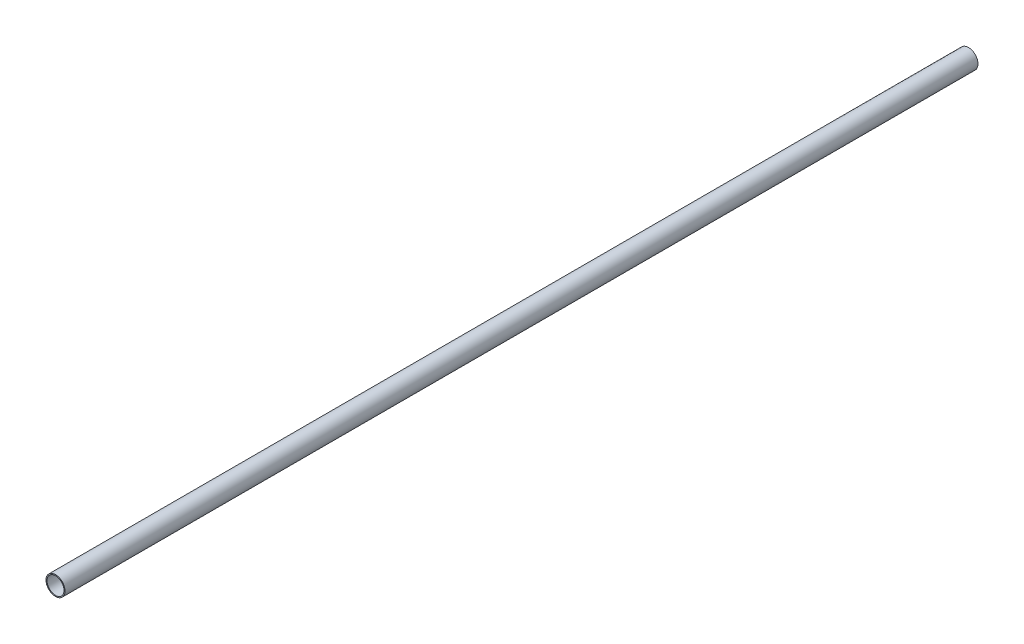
from build123d import *

# Parameters (mm, degrees)
PIPESKETCH_R    = 57.15
PIPESKETCH_R_2  = 51.1302
EXTRUSION_DEPTH = 5486.4


with BuildPart() as part:
    # PipeSketch → Extrusion (new body)
    with BuildSketch(Plane.XY):
        Circle(PIPESKETCH_R)
        Circle(PIPESKETCH_R_2, mode=Mode.SUBTRACT)
    extrude(amount=EXTRUSION_DEPTH)


solid = part.part
